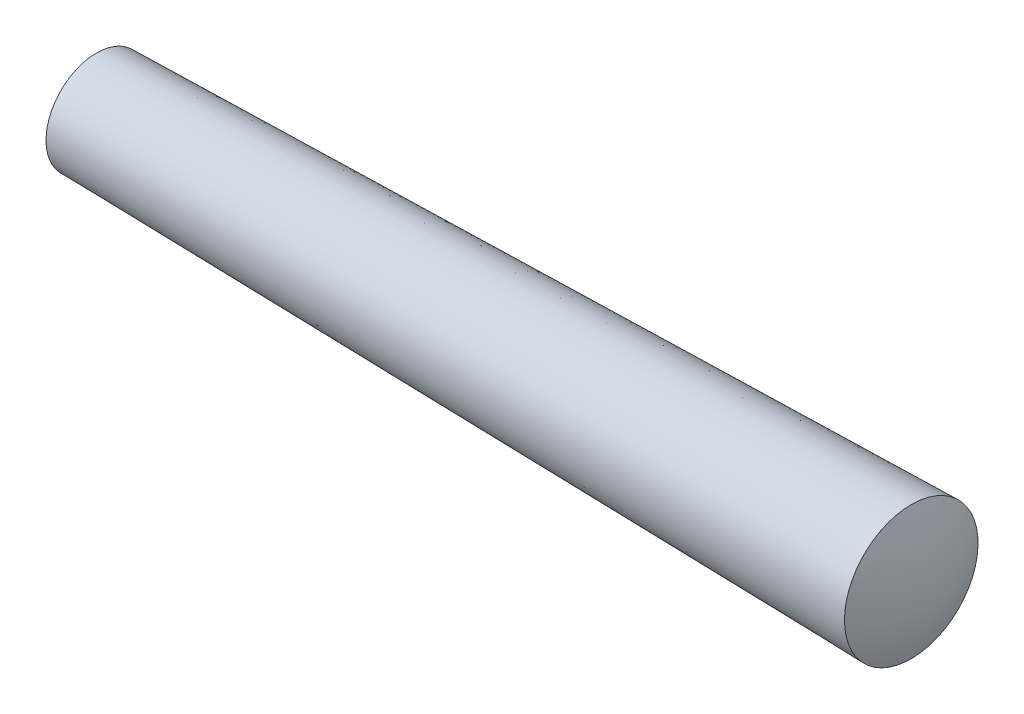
ISO-10303-21;
HEADER;
FILE_DESCRIPTION(('STEP AP214'),'2;1');
FILE_NAME('part.step','',(''),(''),'','','');
FILE_SCHEMA(('AUTOMOTIVE_DESIGN { 1 0 10303 214 1 1 1 1 }'));
ENDSEC;
DATA;
#1=APPLICATION_CONTEXT('core data for automotive mechanical design processes');
#2=APPLICATION_PROTOCOL_DEFINITION('international standard','automotive_design',2000,#1);
#3=PRODUCT_CONTEXT('',#1,'mechanical');
#4=PRODUCT('Part','Part','',(#3));
#5=PRODUCT_RELATED_PRODUCT_CATEGORY('part','',(#4));
#6=PRODUCT_DEFINITION_FORMATION('','',#4);
#7=PRODUCT_DEFINITION_CONTEXT('part definition',#1,'design');
#8=PRODUCT_DEFINITION('design','',#6,#7);
#9=PRODUCT_DEFINITION_SHAPE('','',#8);
#10=(LENGTH_UNIT() NAMED_UNIT(*) SI_UNIT(.MILLI.,.METRE.));
#11=(NAMED_UNIT(*) PLANE_ANGLE_UNIT() SI_UNIT($,.RADIAN.));
#12=(NAMED_UNIT(*) SI_UNIT($,.STERADIAN.) SOLID_ANGLE_UNIT());
#13=UNCERTAINTY_MEASURE_WITH_UNIT(LENGTH_MEASURE(1.E-05),#10,'distance_accuracy_value','');
#14=(GEOMETRIC_REPRESENTATION_CONTEXT(3) GLOBAL_UNCERTAINTY_ASSIGNED_CONTEXT((#13)) GLOBAL_UNIT_ASSIGNED_CONTEXT((#10,
#11,#12)) REPRESENTATION_CONTEXT('',''));
#15=CARTESIAN_POINT('',(0.,0.,0.));
#16=DIRECTION('',(0.,0.,1.));
#17=DIRECTION('',(1.,0.,0.));
#18=AXIS2_PLACEMENT_3D('',#15,#16,#17);
#19=CARTESIAN_POINT('',(0.602499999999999,0.,0.));
#20=DIRECTION('',(-1.,0.,0.));
#21=DIRECTION('',(0.,1.,0.));
#22=AXIS2_PLACEMENT_3D('',#19,#20,#21);
#23=SPHERICAL_SURFACE('',#22,0.602499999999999);
#24=CARTESIAN_POINT('',(0.0799999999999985,0.,0.));
#25=DIRECTION('',(-1.,0.,0.));
#26=DIRECTION('',(0.,0.,1.));
#27=AXIS2_PLACEMENT_3D('',#24,#25,#26);
#28=CIRCLE('',#27,0.3);
#29=CARTESIAN_POINT('',(0.0799999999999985,0.,0.3));
#30=VERTEX_POINT('',#29);
#31=EDGE_CURVE('E36',#30,#30,#28,.T.);
#32=ORIENTED_EDGE('',*,*,#31,.T.);
#33=EDGE_LOOP('',(#32));
#34=FACE_BOUND('',#33,.T.);
#35=ADVANCED_FACE('F30',(#34),#23,.T.);
#36=CARTESIAN_POINT('',(3.97593599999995,0.,0.));
#37=DIRECTION('',(-1.,0.,0.));
#38=DIRECTION('',(0.,1.,0.));
#39=AXIS2_PLACEMENT_3D('',#36,#37,#38);
#40=SPHERICAL_SURFACE('',#39,1.02406400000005);
#41=CARTESIAN_POINT('',(4.92,0.,0.));
#42=DIRECTION('',(-1.,0.,0.));
#43=DIRECTION('',(0.,0.,1.));
#44=AXIS2_PLACEMENT_3D('',#41,#42,#43);
#45=CIRCLE('',#44,0.3968);
#46=CARTESIAN_POINT('',(4.92,0.,0.3968));
#47=VERTEX_POINT('',#46);
#48=EDGE_CURVE('E10',#47,#47,#45,.T.);
#49=ORIENTED_EDGE('',*,*,#48,.F.);
#50=EDGE_LOOP('',(#49));
#51=FACE_BOUND('',#50,.T.);
#52=ADVANCED_FACE('F45',(#51),#40,.T.);
#53=CARTESIAN_POINT('',(4.92,0.,0.));
#54=DIRECTION('',(1.,0.,0.));
#55=DIRECTION('',(0.,0.,-1.));
#56=AXIS2_PLACEMENT_3D('',#53,#54,#55);
#57=CONICAL_SURFACE('',#56,0.3968,0.0199973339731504);
#58=ORIENTED_EDGE('',*,*,#31,.F.);
#59=EDGE_LOOP('',(#58));
#60=FACE_BOUND('',#59,.T.);
#61=ORIENTED_EDGE('',*,*,#48,.T.);
#62=EDGE_LOOP('',(#61));
#63=FACE_BOUND('',#62,.T.);
#64=ADVANCED_FACE('F43',(#60,#63),#57,.T.);
#65=CLOSED_SHELL('',(#35,#52,#64));
#66=MANIFOLD_SOLID_BREP('B2',#65);
#67=ADVANCED_BREP_SHAPE_REPRESENTATION('',(#18,#66),#14);
#68=SHAPE_DEFINITION_REPRESENTATION(#9,#67);
ENDSEC;
END-ISO-10303-21;
